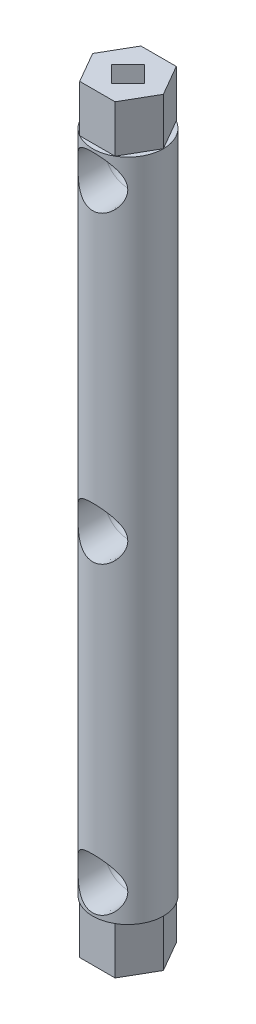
from build123d import *

# Parameters (mm, degrees)
SKETCH1_R                        = 7.5
BOSS_EXTRUDE1_DEPTH              = 141
SKETCH2_R                        = 5
CUT_EXTRUDE1_DEPTH               = 142.398373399
CUT_EXTRUDE1_DRAFT               = -3
CUT_EXTRUDE1_PROFILE_2_DEPTH     = 142.398373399
CUT_EXTRUDE1_PROFILE_2_DRAFT     = -3
CUT_EXTRUDE1_PROFILE_3_DEPTH     = 142.398373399
CUT_EXTRUDE1_PROFILE_3_DRAFT     = -3
BOSS_EXTRUDE2_DEPTH              = 10
BOSS_EXTRUDE3_DEPTH              = 10
F_10_0_1935_DIAMETER_HOLE1_D     = 4.9149
F_10_0_1935_DIAMETER_HOLE1_DEPTH = 5
F_10_0_1935_DIAMETER_HOLE1_TIP   = 1.476584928
F_10_0_1935_DIAMETER_HOLE2_D     = 4.9149
F_10_0_1935_DIAMETER_HOLE2_DEPTH = 5
F_10_0_1935_DIAMETER_HOLE2_TIP   = 1.476584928
CUT_EXTRUDE2_DEPTH               = 10
CUT_EXTRUDE3_DEPTH               = 10


with BuildPart() as part:
    # Sketch1 → Boss-Extrude1 (new body)
    with BuildSketch(Plane(origin=(0, 0, 0), x_dir=(1, 0, 0), z_dir=(0, 1, 0))):
        with Locations(Location((0, 0, 0), (0, 0, 270))):
            Circle(SKETCH1_R)
    extrude(amount=BOSS_EXTRUDE1_DEPTH)


with BuildPart() as cut_extrude1_tool:
    # Sketch2 → Cut-Extrude1 (with draft: the straight prism first)
    with BuildSketch(Plane.XY):
        with Locations((0, 135)):
            Circle(SKETCH2_R)
    extrude(amount=CUT_EXTRUDE1_DEPTH)
    # Cut-Extrude1: the draft: its side faces are tilted about the plane it starts from
    cut_extrude1_sides = [cut_extrude1_tool.faces().sort_by_distance(p)[0] for p in [
        (-5, 135, 71.1991867),
    ]]
    draft(cut_extrude1_sides, Plane.XY, CUT_EXTRUDE1_DRAFT)


with BuildPart() as part_1:
    add(part.part)

    # Cut-Extrude1: cut by cut_extrude1_tool
    add(cut_extrude1_tool.part, mode=Mode.SUBTRACT)


with BuildPart() as cut_extrude1_profile_2_tool:
    # Sketch2 → Cut-Extrude1 profile 2 (with draft: the straight prism first)
    with BuildSketch(Plane.XY):
        with Locations((0, 70.5)):
            Circle(SKETCH2_R)
    extrude(amount=CUT_EXTRUDE1_PROFILE_2_DEPTH)
    # Cut-Extrude1 profile 2: the draft: its side faces are tilted about the plane it starts from
    cut_extrude1_profile_2_sides = [cut_extrude1_profile_2_tool.faces().sort_by_distance(p)[0] for p in [
        (-5, 70.5, 71.1991867),
    ]]
    draft(cut_extrude1_profile_2_sides, Plane.XY, CUT_EXTRUDE1_PROFILE_2_DRAFT)


with BuildPart() as part_2:
    add(part_1.part)

    # Cut-Extrude1 profile 2: cut by cut_extrude1_profile_2_tool
    add(cut_extrude1_profile_2_tool.part, mode=Mode.SUBTRACT)


with BuildPart() as cut_extrude1_profile_3_tool:
    # Sketch2 → Cut-Extrude1 profile 3 (with draft: the straight prism first)
    with BuildSketch(Plane.XY):
        with Locations((0, 6)):
            Circle(SKETCH2_R)
    extrude(amount=CUT_EXTRUDE1_PROFILE_3_DEPTH)
    # Cut-Extrude1 profile 3: the draft: its side faces are tilted about the plane it starts from
    cut_extrude1_profile_3_sides = [cut_extrude1_profile_3_tool.faces().sort_by_distance(p)[0] for p in [
        (-5, 6, 71.1991867),
    ]]
    draft(cut_extrude1_profile_3_sides, Plane.XY, CUT_EXTRUDE1_PROFILE_3_DRAFT)


with BuildPart() as part_3:
    add(part_2.part)

    # Cut-Extrude1 profile 3: cut by cut_extrude1_profile_3_tool
    add(cut_extrude1_profile_3_tool.part, mode=Mode.SUBTRACT)

    # Sketch3 → Cut-Revolve1 (revolve, cut)
    with BuildSketch(Plane.XY):
        with BuildLine():
            Line((0, 11), (0, 1))
            ThreePointArc((0, 1), (5, 6), (0, 11))
        make_face()
        with BuildLine():
            Line((0, 75.5), (0, 65.5))
            ThreePointArc((0, 65.5), (5, 70.5), (0, 75.5))
        make_face()
        with BuildLine():
            Line((0, 140), (0, 130))
            ThreePointArc((0, 130), (5, 135), (0, 140))
        make_face()
    revolve(axis=Axis((0, 141, 0), (0, -1, 0)), mode=Mode.SUBTRACT)

    # Sketch4 → Boss-Extrude2 (add)
    with BuildSketch(Plane(origin=(0, 141, 0), x_dir=(1, 0, 0), z_dir=(0, 1, 0))):
        Polygon((7.5, 0), (3.75, 6.495190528), (-3.75, 6.495190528), (-7.5, 0), (-3.75, -6.495190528), (3.75, -6.495190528), align=None)
    extrude(amount=BOSS_EXTRUDE2_DEPTH)

    # Sketch5 → Boss-Extrude3 (add)
    with BuildSketch(Plane(origin=(0, 0, 0), x_dir=(-1, 0, 0), z_dir=(0, -1, 0))):
        Polygon((-7.5, 0), (-3.75, -6.495190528), (3.75, -6.495190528), (7.5, 0), (3.75, 6.495190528), (-3.75, 6.495190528), align=None)
    extrude(amount=BOSS_EXTRUDE3_DEPTH)

    # 10 _0.1935_ Diameter Hole1
    with Locations(Plane(origin=(0, 151, 0), x_dir=(1, 0, 0), z_dir=(0, 1, 0))):
        with Locations((0, 0)):
            Hole(F_10_0_1935_DIAMETER_HOLE1_D / 2, depth=F_10_0_1935_DIAMETER_HOLE1_DEPTH)
            with Locations((0, 0, -(F_10_0_1935_DIAMETER_HOLE1_DEPTH + F_10_0_1935_DIAMETER_HOLE1_TIP / 2))):  # 118° drill point
                Cone(0, F_10_0_1935_DIAMETER_HOLE1_D / 2, F_10_0_1935_DIAMETER_HOLE1_TIP, mode=Mode.SUBTRACT)

    # 10 _0.1935_ Diameter Hole2
    with Locations(Plane(origin=(0, -10, 0), x_dir=(-1, 0, 0), z_dir=(0, -1, 0))):
        with Locations((0, 0)):
            Hole(F_10_0_1935_DIAMETER_HOLE2_D / 2, depth=F_10_0_1935_DIAMETER_HOLE2_DEPTH)
            with Locations((0, 0, -(F_10_0_1935_DIAMETER_HOLE2_DEPTH + F_10_0_1935_DIAMETER_HOLE2_TIP / 2))):  # 118° drill point
                Cone(0, F_10_0_1935_DIAMETER_HOLE2_D / 2, F_10_0_1935_DIAMETER_HOLE2_TIP, mode=Mode.SUBTRACT)

    # Sketch11 → Cut-Extrude2 (cut)
    with BuildSketch(Plane(origin=(0, 151, 0), x_dir=(1, 0, 0), z_dir=(0, 1, 0))):
        Polygon((0, 3.487644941), (3.487644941, 0), (0, -3.487644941), (-3.487644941, 0), align=None)
    extrude(amount=-CUT_EXTRUDE2_DEPTH, mode=Mode.SUBTRACT)

    # Sketch12 → Cut-Extrude3 (cut)
    with BuildSketch(Plane(origin=(0, -10, 0), x_dir=(-1, 0, 0), z_dir=(0, -1, 0))):
        Polygon((0, -3.487644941), (-3.487644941, 0), (0, 3.487644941), (3.487644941, 0), align=None)
    extrude(amount=-CUT_EXTRUDE3_DEPTH, mode=Mode.SUBTRACT)


solid = part_3.part
